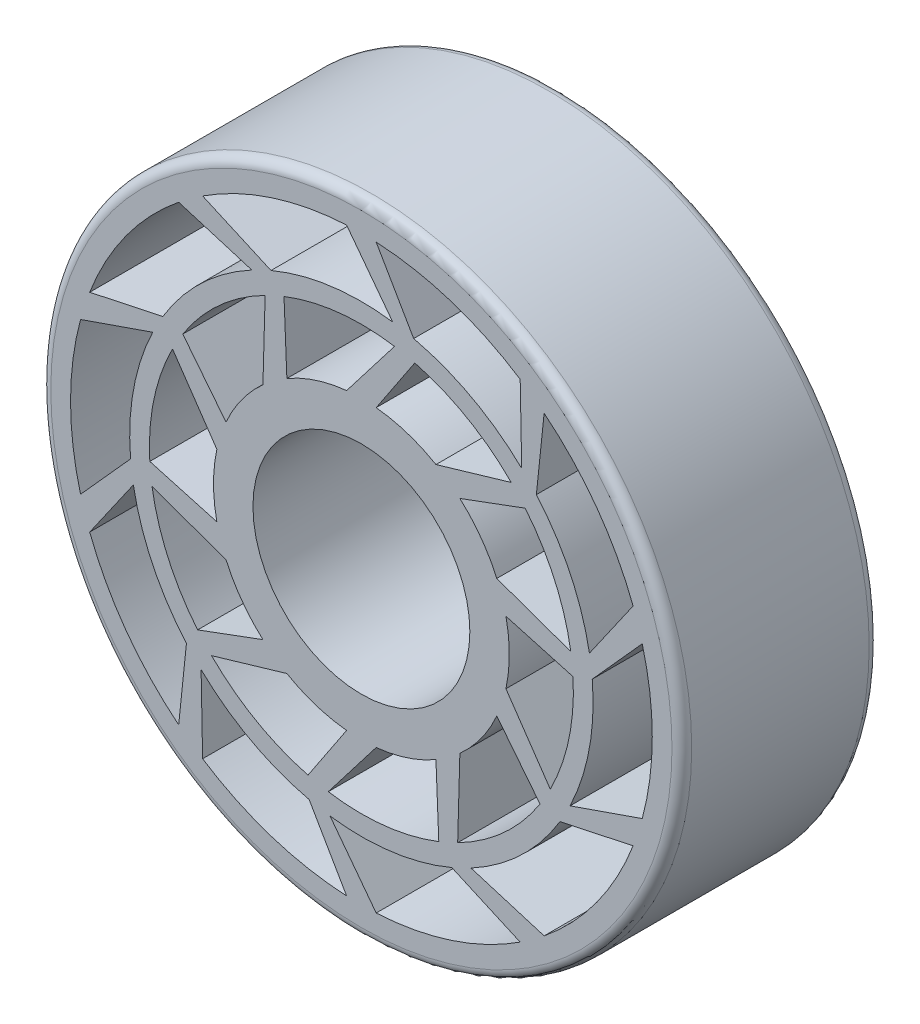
from build123d import *

# Parameters (mm, degrees)
SKETCH1_R           = 32.5
SKETCH1_R_2         = 11
BOSS_EXTRUDE1_DEPTH = 20
CIRPATTERN1_COUNT   = 10
FILLET3_R           = 1


with BuildPart() as part:
    # Sketch1 → Boss-Extrude1 (new body)
    with BuildSketch(Plane.XY):
        Circle(SKETCH1_R)
        with BuildLine():
            ThreePointArc((1.5, -14.924811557), (0, 15), (-1.5, -14.924811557))
            Line((-1.5, -14.924811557), (-5.415297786, -20.806839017))
            ThreePointArc((-5.415297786, -20.806839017), (4.392966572, 21.046421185), (-3.360157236, -21.235803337))
            Line((-3.360157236, -21.235803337), (1.5, -14.924811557))
        make_face(mode=Mode.SUBTRACT)
        with BuildLine():
            ThreePointArc((-3.178455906, -23.284059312), (4.243834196, 23.113629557), (-5.30026699, -22.894479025))
            Line((-5.30026699, -22.894479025), (-1.5, -29.461839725))
            ThreePointArc((-1.5, -29.461839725), (0, 29.5), (1.5, -29.461839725))
            Line((1.5, -29.461839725), (-3.178455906, -23.284059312))
        make_face(mode=Mode.SUBTRACT)
        Circle(SKETCH1_R_2, mode=Mode.SUBTRACT)
    boss_extrude1 = extrude(amount=BOSS_EXTRUDE1_DEPTH)

    # CirPattern1: Boss-Extrude1 ×10 about axis
    cirpattern1_axis = Axis((0, 0, 0), (0, 0, 1))
    for i in range(1, CIRPATTERN1_COUNT):
        add(boss_extrude1.rotate(cirpattern1_axis, i * 360 / CIRPATTERN1_COUNT))

    # Fillet3
    fillet3_edges = [part.edges().sort_by_distance(p)[0] for p in [
        (-32.5, 0, 0),
        (-32.5, 0, 20),
    ]]
    fillet(fillet3_edges, radius=FILLET3_R)


solid = part.part
